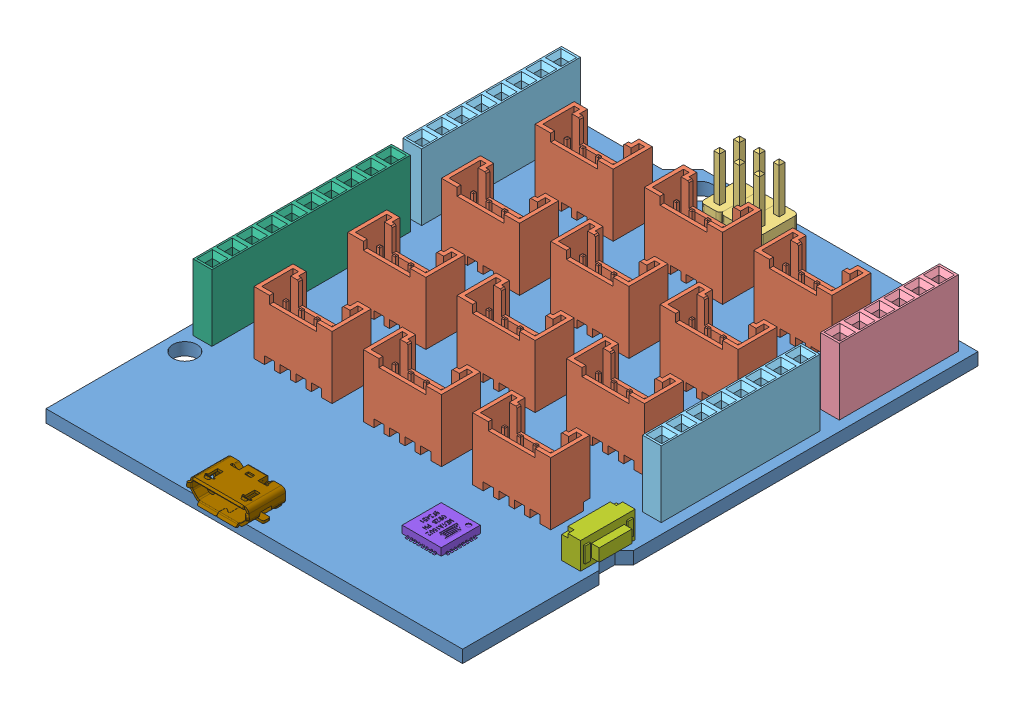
SolidWorks assembly Seeeduino Lotus.SLDASM, configuration Défaut (file format 14000). Lengths in mm.
Overall size (53.34 19.37 69.58).
30 component instances, 11 part files, 0 mates.
Components (placement in the parent):
- Lotus seeedstudio-1: Lotus seeedstudio.SLDASM [Défaut] at (-13.7768 12.6871 -16.7611) x (0 0 -1) z (0 1 0) size (69.58 53.34 11.76)
  - PCB Lotus-1: PCB Lotus.SLDPRT [Défaut] at (-41.2611 -23.1126 -0.8) size (68.58 53.34 1.6)
  - Connecteur Grove (droit)-1: Connecteur Grove (droit).SLDPRT [Défaut] at (-17.3889 -10.5311 0.8) x (0 1 0) z (1 0 0) size (10 11 5)
  - Connecteur Grove (droit)-2: Connecteur Grove (droit).SLDPRT [Défaut] at (-5.3889 -10.5311 0.8) x (0 1 0) z (1 0 0) size (10 11 5)
  - Connecteur Grove (droit)-3: Connecteur Grove (droit).SLDPRT [Défaut] at (6.6111 -10.5311 0.8) x (0 1 0) z (1 0 0) size (10 11 5)
  - Connecteur Grove (droit)-4: Connecteur Grove (droit).SLDPRT [Défaut] at (18.6111 -10.5311 0.8) x (0 1 0) z (1 0 0) size (10 11 5)
  - Connecteur Grove (droit)-5: Connecteur Grove (droit).SLDPRT [Défaut] at (-17.3889 3.4689 0.8) x (0 1 0) z (1 0 0) size (10 11 5)
  - Connecteur Grove (droit)-6: Connecteur Grove (droit).SLDPRT [Défaut] at (-5.3889 3.4689 0.8) x (0 1 0) z (1 0 0) size (10 11 5)
  - Connecteur Grove (droit)-7: Connecteur Grove (droit).SLDPRT [Défaut] at (6.6111 3.4689 0.8) x (0 1 0) z (1 0 0) size (10 11 5)
  - Connecteur Grove (droit)-8: Connecteur Grove (droit).SLDPRT [Défaut] at (18.6111 3.4689 0.8) x (0 1 0) z (1 0 0) size (10 11 5)
  - Connecteur Grove (droit)-9: Connecteur Grove (droit).SLDPRT [Défaut] at (-17.3889 17.4689 0.8) x (0 1 0) z (1 0 0) size (10 11 5)
  - Connecteur Grove (droit)-10: Connecteur Grove (droit).SLDPRT [Défaut] at (-5.3889 17.4689 0.8) x (0 1 0) z (1 0 0) size (10 11 5)
  - Connecteur Grove (droit)-11: Connecteur Grove (droit).SLDPRT [Défaut] at (6.6111 17.4689 0.8) x (0 1 0) z (1 0 0) size (10 11 5)
  - Connecteur Grove (droit)-12: Connecteur Grove (droit).SLDPRT [Défaut] at (18.6111 17.4689 0.8) x (0 1 0) z (1 0 0) size (10 11 5)
  - 2pin_header__02 Y-1: 2pin_header__02 Y.sldprt [Default] at (23.5406 7.504 0.8) x (1 0 0) z (0 -1 0) size (5 11.75 2.54)
  - 6 PORT HEADER Y-1: 6 PORT HEADER Y.SLDPRT [Default] at (9.5283 -20.6231 0.8) x (1 0 0) z (0 -1 0) size (15.24 10.51 2.41)
  - 8 PORT HEADER Y-1: 8 PORT HEADER Y.SLDPRT [Default] at (-13.2368 -20.594 0.8) x (1 0 0) z (0 -1 0) size (20.32 10.51 2.41)
  - 8 PORT HEADER Y-2: 8 PORT HEADER Y.SLDPRT [Default] at (4.3577 27.6832 0.8) x (1 0 0) z (0 -1 0) size (20.32 10.51 2.41)
  - 10 PORT HEADER Y-1: 10 PORT HEADER Y.SLDPRT [Default] at (-22.4666 27.7113 0.8) x (1 0 0) z (0 -1 0) size (25.4 10.51 2.41)
  - 2pin_header__02 Y-2: 2pin_header__02 Y.sldprt [Default] at (23.5406 4.964 0.8) x (1 0 0) z (0 -1 0) size (5 11.75 2.54)
  - 2pin_header__02 Y-3: 2pin_header__02 Y.sldprt [Default] at (23.5406 2.424 0.8) x (1 0 0) z (0 -1 0) size (5 11.75 2.54)
  - Bouton_RST - CMS-1: Bouton_RST - CMS.SLDPRT [Défaut] at (-21.577 -20.8281 0.8) x (1 0 0) z (0 -1 0) size (7 3.4 3.4)
  - atmega16u2-1: atmega16u2.SLDPRT [Default] at (-29.8717 -8.9881 0.85) x (1 0 0) z (0 1 0) size (5.5 1.01 5.5)
  - micro_usb_47346-0001-1: micro_usb_47346-0001.SLDPRT [Default] at (-39.4811 7.4215 2.025) x (0 -1 0) z (-1 0 0) size (7.98 2.94 5.43)
- ent-3x4-1: ent-3x4.SLDPRT [Défaut] at (1.7416 11.6776 -40.1862) x (0 -1 0) z (-1 0 0) size (3 4 4)
- ent-3x4-2: ent-3x4.SLDPRT [Défaut] at (-41.442 11.6776 10.5682) x (0 -1 0) z (-1 0 0) size (3 4 4)
- ent-3x4-3: ent-3x4.SLDPRT [Défaut] at (-26.2041 11.6776 -40.1958) x (0 -1 0) z (-1 0 0) size (3 4 4)
- V-m2x12-1: V-m2x12.SLDPRT [Défaut] at (-26.0836 13.6288 -41.2937) x (0 -1 0) z (-1 0 0) size (11 4 4)
- V-m2x12-2: V-m2x12.SLDPRT [Défaut] at (1.8577 13.6288 -41.2318) x (0 -1 0) z (-1 0 0) size (11 4 4)
- V-m2x12-3: V-m2x12.SLDPRT [Défaut] at (-41.4608 13.6288 9.2647) x (0 -1 0) z (-1 0 0) size (11 4 4)
